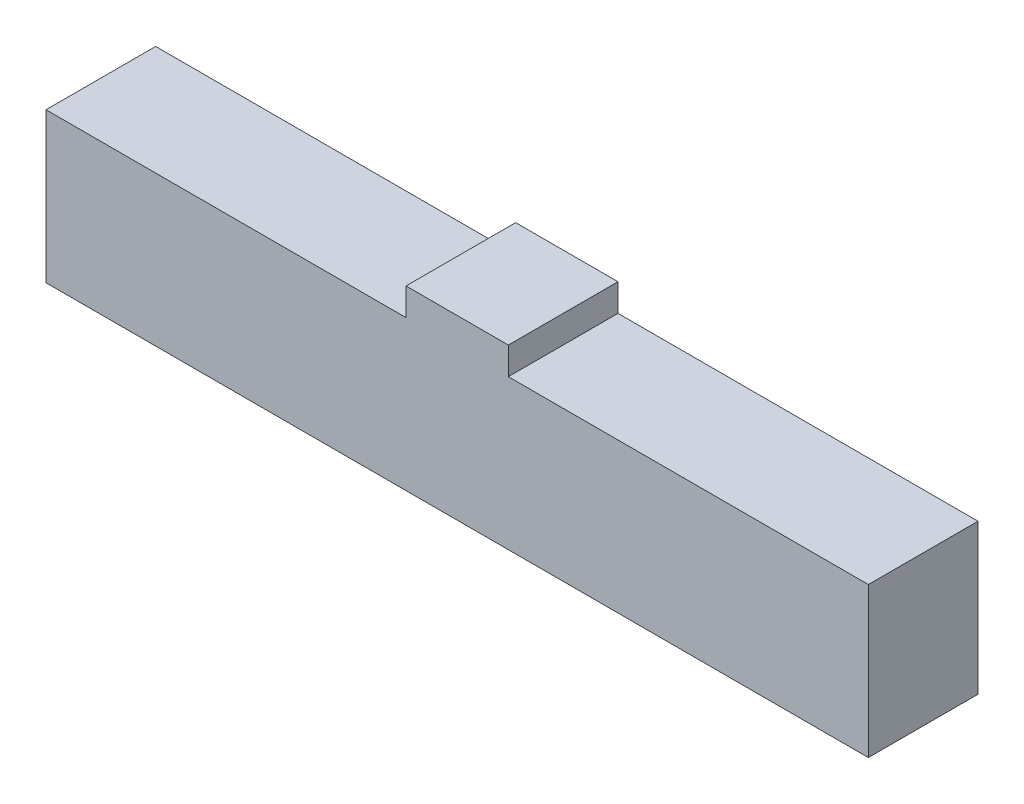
ISO-10303-21;
HEADER;
FILE_DESCRIPTION(('STEP AP214'),'2;1');
FILE_NAME('part.step','',(''),(''),'','','');
FILE_SCHEMA(('AUTOMOTIVE_DESIGN { 1 0 10303 214 1 1 1 1 }'));
ENDSEC;
DATA;
#1=APPLICATION_CONTEXT('core data for automotive mechanical design processes');
#2=APPLICATION_PROTOCOL_DEFINITION('international standard','automotive_design',2000,#1);
#3=PRODUCT_CONTEXT('',#1,'mechanical');
#4=PRODUCT('Part','Part','',(#3));
#5=PRODUCT_RELATED_PRODUCT_CATEGORY('part','',(#4));
#6=PRODUCT_DEFINITION_FORMATION('','',#4);
#7=PRODUCT_DEFINITION_CONTEXT('part definition',#1,'design');
#8=PRODUCT_DEFINITION('design','',#6,#7);
#9=PRODUCT_DEFINITION_SHAPE('','',#8);
#10=(LENGTH_UNIT() NAMED_UNIT(*) SI_UNIT(.MILLI.,.METRE.));
#11=(NAMED_UNIT(*) PLANE_ANGLE_UNIT() SI_UNIT($,.RADIAN.));
#12=(NAMED_UNIT(*) SI_UNIT($,.STERADIAN.) SOLID_ANGLE_UNIT());
#13=UNCERTAINTY_MEASURE_WITH_UNIT(LENGTH_MEASURE(1.E-05),#10,'distance_accuracy_value','');
#14=(GEOMETRIC_REPRESENTATION_CONTEXT(3) GLOBAL_UNCERTAINTY_ASSIGNED_CONTEXT((#13)) GLOBAL_UNIT_ASSIGNED_CONTEXT((#10,
#11,#12)) REPRESENTATION_CONTEXT('',''));
#15=CARTESIAN_POINT('',(0.,0.,0.));
#16=DIRECTION('',(0.,0.,1.));
#17=DIRECTION('',(1.,0.,0.));
#18=AXIS2_PLACEMENT_3D('',#15,#16,#17);
#19=CARTESIAN_POINT('',(1.8,3.1,6.));
#20=DIRECTION('',(0.,-1.,0.));
#21=DIRECTION('',(1.,0.,0.));
#22=AXIS2_PLACEMENT_3D('',#19,#20,#21);
#23=PLANE('',#22);
#24=DIRECTION('',(0.,0.,-1.));
#25=VECTOR('',#24,1.);
#26=CARTESIAN_POINT('',(21.5,3.1,6.));
#27=LINE('',#26,#25);
#28=CARTESIAN_POINT('',(21.5,3.1,5.));
#29=VERTEX_POINT('',#28);
#30=CARTESIAN_POINT('',(21.5,3.1,0.));
#31=VERTEX_POINT('',#30);
#32=EDGE_CURVE('E117',#29,#31,#27,.T.);
#33=ORIENTED_EDGE('',*,*,#32,.F.);
#34=DIRECTION('',(-1.,0.,0.));
#35=VECTOR('',#34,1.);
#36=CARTESIAN_POINT('',(1.8,3.1,5.));
#37=LINE('',#36,#35);
#38=CARTESIAN_POINT('',(1.8,3.1,5.));
#39=VERTEX_POINT('',#38);
#40=EDGE_CURVE('E111',#29,#39,#37,.T.);
#41=ORIENTED_EDGE('',*,*,#40,.T.);
#42=DIRECTION('',(0.,0.,-1.));
#43=VECTOR('',#42,1.);
#44=CARTESIAN_POINT('',(1.8,3.1,6.));
#45=LINE('',#44,#43);
#46=CARTESIAN_POINT('',(1.8,3.1,0.));
#47=VERTEX_POINT('',#46);
#48=EDGE_CURVE('E268',#39,#47,#45,.T.);
#49=ORIENTED_EDGE('',*,*,#48,.T.);
#50=DIRECTION('',(-1.,0.,0.));
#51=VECTOR('',#50,1.);
#52=CARTESIAN_POINT('',(1.8,3.1,0.));
#53=LINE('',#52,#51);
#54=EDGE_CURVE('E610',#31,#47,#53,.T.);
#55=ORIENTED_EDGE('',*,*,#54,.F.);
#56=EDGE_LOOP('',(#33,#41,#49,#55));
#57=FACE_BOUND('',#56,.T.);
#58=ADVANCED_FACE('F96',(#57),#23,.T.);
#59=CARTESIAN_POINT('',(1.8,4.6,6.));
#60=DIRECTION('',(-1.,0.,0.));
#61=DIRECTION('',(0.,0.,1.));
#62=AXIS2_PLACEMENT_3D('',#59,#60,#61);
#63=PLANE('',#62);
#64=ORIENTED_EDGE('',*,*,#48,.F.);
#65=DIRECTION('',(0.,1.,0.));
#66=VECTOR('',#65,1.);
#67=CARTESIAN_POINT('',(1.8,4.6,5.));
#68=LINE('',#67,#66);
#69=CARTESIAN_POINT('',(1.8,4.6,5.));
#70=VERTEX_POINT('',#69);
#71=EDGE_CURVE('E606',#39,#70,#68,.T.);
#72=ORIENTED_EDGE('',*,*,#71,.T.);
#73=DIRECTION('',(0.,0.,-1.));
#74=VECTOR('',#73,1.);
#75=CARTESIAN_POINT('',(1.8,4.6,6.));
#76=LINE('',#75,#74);
#77=CARTESIAN_POINT('',(1.8,4.6,0.));
#78=VERTEX_POINT('',#77);
#79=EDGE_CURVE('E266',#70,#78,#76,.T.);
#80=ORIENTED_EDGE('',*,*,#79,.T.);
#81=DIRECTION('',(0.,1.,0.));
#82=VECTOR('',#81,1.);
#83=CARTESIAN_POINT('',(1.8,4.6,0.));
#84=LINE('',#83,#82);
#85=EDGE_CURVE('E613',#47,#78,#84,.T.);
#86=ORIENTED_EDGE('',*,*,#85,.F.);
#87=EDGE_LOOP('',(#64,#72,#80,#86));
#88=FACE_BOUND('',#87,.T.);
#89=ADVANCED_FACE('F377',(#88),#63,.T.);
#90=CARTESIAN_POINT('',(0.4,4.6,6.));
#91=DIRECTION('',(0.,-1.,0.));
#92=DIRECTION('',(0.,0.,-1.));
#93=AXIS2_PLACEMENT_3D('',#90,#91,#92);
#94=PLANE('',#93);
#95=ORIENTED_EDGE('',*,*,#79,.F.);
#96=DIRECTION('',(-1.,0.,0.));
#97=VECTOR('',#96,1.);
#98=CARTESIAN_POINT('',(0.4,4.6,5.));
#99=LINE('',#98,#97);
#100=CARTESIAN_POINT('',(0.4,4.6,5.));
#101=VERTEX_POINT('',#100);
#102=EDGE_CURVE('E603',#70,#101,#99,.T.);
#103=ORIENTED_EDGE('',*,*,#102,.T.);
#104=DIRECTION('',(0.,0.,-1.));
#105=VECTOR('',#104,1.);
#106=CARTESIAN_POINT('',(0.4,4.6,6.));
#107=LINE('',#106,#105);
#108=CARTESIAN_POINT('',(0.4,4.6,0.));
#109=VERTEX_POINT('',#108);
#110=EDGE_CURVE('E264',#101,#109,#107,.T.);
#111=ORIENTED_EDGE('',*,*,#110,.T.);
#112=DIRECTION('',(-1.,0.,0.));
#113=VECTOR('',#112,1.);
#114=CARTESIAN_POINT('',(0.4,4.6,0.));
#115=LINE('',#114,#113);
#116=EDGE_CURVE('E616',#78,#109,#115,.T.);
#117=ORIENTED_EDGE('',*,*,#116,.F.);
#118=EDGE_LOOP('',(#95,#103,#111,#117));
#119=FACE_BOUND('',#118,.T.);
#120=ADVANCED_FACE('F382',(#119),#94,.T.);
#121=CARTESIAN_POINT('',(0.4,3.1,6.));
#122=DIRECTION('',(1.,0.,0.));
#123=DIRECTION('',(0.,0.,-1.));
#124=AXIS2_PLACEMENT_3D('',#121,#122,#123);
#125=PLANE('',#124);
#126=ORIENTED_EDGE('',*,*,#110,.F.);
#127=DIRECTION('',(0.,-1.,0.));
#128=VECTOR('',#127,1.);
#129=CARTESIAN_POINT('',(0.4,3.1,5.));
#130=LINE('',#129,#128);
#131=CARTESIAN_POINT('',(0.4,3.1,5.));
#132=VERTEX_POINT('',#131);
#133=EDGE_CURVE('E600',#101,#132,#130,.T.);
#134=ORIENTED_EDGE('',*,*,#133,.T.);
#135=DIRECTION('',(0.,0.,-1.));
#136=VECTOR('',#135,1.);
#137=CARTESIAN_POINT('',(0.4,3.1,6.));
#138=LINE('',#137,#136);
#139=CARTESIAN_POINT('',(0.4,3.1,0.));
#140=VERTEX_POINT('',#139);
#141=EDGE_CURVE('E262',#132,#140,#138,.T.);
#142=ORIENTED_EDGE('',*,*,#141,.T.);
#143=DIRECTION('',(0.,-1.,0.));
#144=VECTOR('',#143,1.);
#145=CARTESIAN_POINT('',(0.4,3.1,0.));
#146=LINE('',#145,#144);
#147=EDGE_CURVE('E619',#109,#140,#146,.T.);
#148=ORIENTED_EDGE('',*,*,#147,.F.);
#149=EDGE_LOOP('',(#126,#134,#142,#148));
#150=FACE_BOUND('',#149,.T.);
#151=ADVANCED_FACE('F388',(#150),#125,.T.);
#152=CARTESIAN_POINT('',(-0.4,3.1,6.));
#153=DIRECTION('',(0.,-1.,0.));
#154=DIRECTION('',(0.,0.,-1.));
#155=AXIS2_PLACEMENT_3D('',#152,#153,#154);
#156=PLANE('',#155);
#157=ORIENTED_EDGE('',*,*,#141,.F.);
#158=DIRECTION('',(-1.,0.,0.));
#159=VECTOR('',#158,1.);
#160=CARTESIAN_POINT('',(-0.4,3.1,5.));
#161=LINE('',#160,#159);
#162=CARTESIAN_POINT('',(-0.4,3.1,5.));
#163=VERTEX_POINT('',#162);
#164=EDGE_CURVE('E597',#132,#163,#161,.T.);
#165=ORIENTED_EDGE('',*,*,#164,.T.);
#166=DIRECTION('',(0.,0.,-1.));
#167=VECTOR('',#166,1.);
#168=CARTESIAN_POINT('',(-0.4,3.1,6.));
#169=LINE('',#168,#167);
#170=CARTESIAN_POINT('',(-0.4,3.1,0.));
#171=VERTEX_POINT('',#170);
#172=EDGE_CURVE('E260',#163,#171,#169,.T.);
#173=ORIENTED_EDGE('',*,*,#172,.T.);
#174=DIRECTION('',(-1.,0.,0.));
#175=VECTOR('',#174,1.);
#176=CARTESIAN_POINT('',(-0.4,3.1,0.));
#177=LINE('',#176,#175);
#178=EDGE_CURVE('E622',#140,#171,#177,.T.);
#179=ORIENTED_EDGE('',*,*,#178,.F.);
#180=EDGE_LOOP('',(#157,#165,#173,#179));
#181=FACE_BOUND('',#180,.T.);
#182=ADVANCED_FACE('F392',(#181),#156,.T.);
#183=CARTESIAN_POINT('',(-0.4,4.6,6.));
#184=DIRECTION('',(-1.,0.,0.));
#185=DIRECTION('',(0.,0.,1.));
#186=AXIS2_PLACEMENT_3D('',#183,#184,#185);
#187=PLANE('',#186);
#188=ORIENTED_EDGE('',*,*,#172,.F.);
#189=DIRECTION('',(0.,1.,0.));
#190=VECTOR('',#189,1.);
#191=CARTESIAN_POINT('',(-0.4,4.6,5.));
#192=LINE('',#191,#190);
#193=CARTESIAN_POINT('',(-0.4,4.6,5.));
#194=VERTEX_POINT('',#193);
#195=EDGE_CURVE('E594',#163,#194,#192,.T.);
#196=ORIENTED_EDGE('',*,*,#195,.T.);
#197=DIRECTION('',(0.,0.,-1.));
#198=VECTOR('',#197,1.);
#199=CARTESIAN_POINT('',(-0.4,4.6,6.));
#200=LINE('',#199,#198);
#201=CARTESIAN_POINT('',(-0.4,4.6,0.));
#202=VERTEX_POINT('',#201);
#203=EDGE_CURVE('E258',#194,#202,#200,.T.);
#204=ORIENTED_EDGE('',*,*,#203,.T.);
#205=DIRECTION('',(0.,1.,0.));
#206=VECTOR('',#205,1.);
#207=CARTESIAN_POINT('',(-0.4,4.6,0.));
#208=LINE('',#207,#206);
#209=EDGE_CURVE('E625',#171,#202,#208,.T.);
#210=ORIENTED_EDGE('',*,*,#209,.F.);
#211=EDGE_LOOP('',(#188,#196,#204,#210));
#212=FACE_BOUND('',#211,.T.);
#213=ADVANCED_FACE('F396',(#212),#187,.T.);
#214=CARTESIAN_POINT('',(-1.8,4.6,6.));
#215=DIRECTION('',(0.,-1.,0.));
#216=DIRECTION('',(0.,0.,-1.));
#217=AXIS2_PLACEMENT_3D('',#214,#215,#216);
#218=PLANE('',#217);
#219=ORIENTED_EDGE('',*,*,#203,.F.);
#220=DIRECTION('',(-1.,0.,0.));
#221=VECTOR('',#220,1.);
#222=CARTESIAN_POINT('',(-1.8,4.6,5.));
#223=LINE('',#222,#221);
#224=CARTESIAN_POINT('',(-1.8,4.6,5.));
#225=VERTEX_POINT('',#224);
#226=EDGE_CURVE('E588',#194,#225,#223,.T.);
#227=ORIENTED_EDGE('',*,*,#226,.T.);
#228=DIRECTION('',(0.,0.,-1.));
#229=VECTOR('',#228,1.);
#230=CARTESIAN_POINT('',(-1.8,4.6,6.));
#231=LINE('',#230,#229);
#232=CARTESIAN_POINT('',(-1.8,4.6,0.));
#233=VERTEX_POINT('',#232);
#234=EDGE_CURVE('E256',#225,#233,#231,.T.);
#235=ORIENTED_EDGE('',*,*,#234,.T.);
#236=DIRECTION('',(-1.,0.,0.));
#237=VECTOR('',#236,1.);
#238=CARTESIAN_POINT('',(-1.8,4.6,0.));
#239=LINE('',#238,#237);
#240=EDGE_CURVE('E628',#202,#233,#239,.T.);
#241=ORIENTED_EDGE('',*,*,#240,.F.);
#242=EDGE_LOOP('',(#219,#227,#235,#241));
#243=FACE_BOUND('',#242,.T.);
#244=ADVANCED_FACE('F400',(#243),#218,.T.);
#245=CARTESIAN_POINT('',(-1.8,3.1,6.));
#246=DIRECTION('',(1.,0.,0.));
#247=DIRECTION('',(0.,0.,-1.));
#248=AXIS2_PLACEMENT_3D('',#245,#246,#247);
#249=PLANE('',#248);
#250=ORIENTED_EDGE('',*,*,#234,.F.);
#251=DIRECTION('',(0.,-1.,0.));
#252=VECTOR('',#251,1.);
#253=CARTESIAN_POINT('',(-1.8,3.1,5.));
#254=LINE('',#253,#252);
#255=CARTESIAN_POINT('',(-1.8,3.1,5.));
#256=VERTEX_POINT('',#255);
#257=EDGE_CURVE('E586',#225,#256,#254,.T.);
#258=ORIENTED_EDGE('',*,*,#257,.T.);
#259=DIRECTION('',(0.,0.,-1.));
#260=VECTOR('',#259,1.);
#261=CARTESIAN_POINT('',(-1.8,3.1,6.));
#262=LINE('',#261,#260);
#263=CARTESIAN_POINT('',(-1.8,3.1,0.));
#264=VERTEX_POINT('',#263);
#265=EDGE_CURVE('E254',#256,#264,#262,.T.);
#266=ORIENTED_EDGE('',*,*,#265,.T.);
#267=DIRECTION('',(0.,-1.,0.));
#268=VECTOR('',#267,1.);
#269=CARTESIAN_POINT('',(-1.8,3.1,0.));
#270=LINE('',#269,#268);
#271=EDGE_CURVE('E631',#233,#264,#270,.T.);
#272=ORIENTED_EDGE('',*,*,#271,.F.);
#273=EDGE_LOOP('',(#250,#258,#266,#272));
#274=FACE_BOUND('',#273,.T.);
#275=ADVANCED_FACE('F404',(#274),#249,.T.);
#276=CARTESIAN_POINT('',(-21.5,3.1,6.));
#277=DIRECTION('',(0.,-1.,0.));
#278=DIRECTION('',(0.,0.,-1.));
#279=AXIS2_PLACEMENT_3D('',#276,#277,#278);
#280=PLANE('',#279);
#281=ORIENTED_EDGE('',*,*,#265,.F.);
#282=DIRECTION('',(-1.,0.,0.));
#283=VECTOR('',#282,1.);
#284=CARTESIAN_POINT('',(-21.5,3.1,5.));
#285=LINE('',#284,#283);
#286=CARTESIAN_POINT('',(-21.5,3.1,5.));
#287=VERTEX_POINT('',#286);
#288=EDGE_CURVE('E584',#256,#287,#285,.T.);
#289=ORIENTED_EDGE('',*,*,#288,.T.);
#290=DIRECTION('',(0.,0.,-1.));
#291=VECTOR('',#290,1.);
#292=CARTESIAN_POINT('',(-21.5,3.1,6.));
#293=LINE('',#292,#291);
#294=CARTESIAN_POINT('',(-21.5,3.1,0.));
#295=VERTEX_POINT('',#294);
#296=EDGE_CURVE('E248',#287,#295,#293,.T.);
#297=ORIENTED_EDGE('',*,*,#296,.T.);
#298=DIRECTION('',(-1.,0.,0.));
#299=VECTOR('',#298,1.);
#300=CARTESIAN_POINT('',(-21.5,3.1,0.));
#301=LINE('',#300,#299);
#302=EDGE_CURVE('E582',#264,#295,#301,.T.);
#303=ORIENTED_EDGE('',*,*,#302,.F.);
#304=EDGE_LOOP('',(#281,#289,#297,#303));
#305=FACE_BOUND('',#304,.T.);
#306=ADVANCED_FACE('F408',(#305),#280,.T.);
#307=CARTESIAN_POINT('',(-21.5,-3.1,6.));
#308=DIRECTION('',(1.,0.,0.));
#309=DIRECTION('',(0.,0.,-1.));
#310=AXIS2_PLACEMENT_3D('',#307,#308,#309);
#311=PLANE('',#310);
#312=ORIENTED_EDGE('',*,*,#296,.F.);
#313=DIRECTION('',(0.,-1.,0.));
#314=VECTOR('',#313,1.);
#315=CARTESIAN_POINT('',(-21.5,-3.1,5.));
#316=LINE('',#315,#314);
#317=CARTESIAN_POINT('',(-21.5,-3.1,5.));
#318=VERTEX_POINT('',#317);
#319=EDGE_CURVE('E241',#287,#318,#316,.T.);
#320=ORIENTED_EDGE('',*,*,#319,.T.);
#321=DIRECTION('',(0.,0.,-1.));
#322=VECTOR('',#321,1.);
#323=CARTESIAN_POINT('',(-21.5,-3.1,6.));
#324=LINE('',#323,#322);
#325=CARTESIAN_POINT('',(-21.5,-3.1,0.));
#326=VERTEX_POINT('',#325);
#327=EDGE_CURVE('E240',#318,#326,#324,.T.);
#328=ORIENTED_EDGE('',*,*,#327,.T.);
#329=DIRECTION('',(0.,-1.,0.));
#330=VECTOR('',#329,1.);
#331=CARTESIAN_POINT('',(-21.5,-3.1,0.));
#332=LINE('',#331,#330);
#333=EDGE_CURVE('E577',#295,#326,#332,.T.);
#334=ORIENTED_EDGE('',*,*,#333,.F.);
#335=EDGE_LOOP('',(#312,#320,#328,#334));
#336=FACE_BOUND('',#335,.T.);
#337=ADVANCED_FACE('F412',(#336),#311,.T.);
#338=CARTESIAN_POINT('',(-21.5,-3.1,6.));
#339=DIRECTION('',(0.,1.,0.));
#340=DIRECTION('',(0.,0.,1.));
#341=AXIS2_PLACEMENT_3D('',#338,#339,#340);
#342=PLANE('',#341);
#343=ORIENTED_EDGE('',*,*,#327,.F.);
#344=DIRECTION('',(1.,0.,0.));
#345=VECTOR('',#344,1.);
#346=CARTESIAN_POINT('',(-21.5,-3.1,5.));
#347=LINE('',#346,#345);
#348=CARTESIAN_POINT('',(21.5,-3.1,5.));
#349=VERTEX_POINT('',#348);
#350=EDGE_CURVE('E232',#318,#349,#347,.T.);
#351=ORIENTED_EDGE('',*,*,#350,.T.);
#352=DIRECTION('',(0.,0.,-1.));
#353=VECTOR('',#352,1.);
#354=CARTESIAN_POINT('',(21.5,-3.1,6.));
#355=LINE('',#354,#353);
#356=CARTESIAN_POINT('',(21.5,-3.1,0.));
#357=VERTEX_POINT('',#356);
#358=EDGE_CURVE('E239',#349,#357,#355,.T.);
#359=ORIENTED_EDGE('',*,*,#358,.T.);
#360=DIRECTION('',(1.,0.,0.));
#361=VECTOR('',#360,1.);
#362=CARTESIAN_POINT('',(-21.5,-3.1,0.));
#363=LINE('',#362,#361);
#364=EDGE_CURVE('E635',#326,#357,#363,.T.);
#365=ORIENTED_EDGE('',*,*,#364,.F.);
#366=EDGE_LOOP('',(#343,#351,#359,#365));
#367=FACE_BOUND('',#366,.T.);
#368=ADVANCED_FACE('F237',(#367),#342,.T.);
#369=CARTESIAN_POINT('',(21.5,-3.1,6.));
#370=DIRECTION('',(-1.,0.,0.));
#371=DIRECTION('',(0.,0.,1.));
#372=AXIS2_PLACEMENT_3D('',#369,#370,#371);
#373=PLANE('',#372);
#374=ORIENTED_EDGE('',*,*,#358,.F.);
#375=DIRECTION('',(0.,1.,0.));
#376=VECTOR('',#375,1.);
#377=CARTESIAN_POINT('',(21.5,-3.1,5.));
#378=LINE('',#377,#376);
#379=EDGE_CURVE('E12',#349,#29,#378,.T.);
#380=ORIENTED_EDGE('',*,*,#379,.T.);
#381=ORIENTED_EDGE('',*,*,#32,.T.);
#382=DIRECTION('',(0.,1.,0.));
#383=VECTOR('',#382,1.);
#384=CARTESIAN_POINT('',(21.5,-3.1,0.));
#385=LINE('',#384,#383);
#386=EDGE_CURVE('E245',#357,#31,#385,.T.);
#387=ORIENTED_EDGE('',*,*,#386,.F.);
#388=EDGE_LOOP('',(#374,#380,#381,#387));
#389=FACE_BOUND('',#388,.T.);
#390=ADVANCED_FACE('F243',(#389),#373,.T.);
#391=CARTESIAN_POINT('',(2.8,4.1,6.));
#392=DIRECTION('',(0.,0.,-1.));
#393=DIRECTION('',(-1.,0.,0.));
#394=AXIS2_PLACEMENT_3D('',#391,#392,#393);
#395=PLANE('',#394);
#396=DIRECTION('',(-1.,0.,0.));
#397=VECTOR('',#396,1.);
#398=CARTESIAN_POINT('',(1.8,4.1,6.));
#399=LINE('',#398,#397);
#400=CARTESIAN_POINT('',(22.5,4.1,6.));
#401=VERTEX_POINT('',#400);
#402=CARTESIAN_POINT('',(2.8,4.1,6.));
#403=VERTEX_POINT('',#402);
#404=EDGE_CURVE('E271',#401,#403,#399,.T.);
#405=ORIENTED_EDGE('',*,*,#404,.T.);
#406=DIRECTION('',(0.,1.,0.));
#407=VECTOR('',#406,1.);
#408=CARTESIAN_POINT('',(2.8,4.6,6.));
#409=LINE('',#408,#407);
#410=CARTESIAN_POINT('',(2.8,5.6,6.));
#411=VERTEX_POINT('',#410);
#412=EDGE_CURVE('E274',#403,#411,#409,.T.);
#413=ORIENTED_EDGE('',*,*,#412,.T.);
#414=DIRECTION('',(-1.,0.,0.));
#415=VECTOR('',#414,1.);
#416=CARTESIAN_POINT('',(-1.8,5.6,6.));
#417=LINE('',#416,#415);
#418=CARTESIAN_POINT('',(-2.8,5.6,6.));
#419=VERTEX_POINT('',#418);
#420=EDGE_CURVE('E277',#411,#419,#417,.T.);
#421=ORIENTED_EDGE('',*,*,#420,.T.);
#422=DIRECTION('',(0.,-1.,0.));
#423=VECTOR('',#422,1.);
#424=CARTESIAN_POINT('',(-2.8,3.1,6.));
#425=LINE('',#424,#423);
#426=CARTESIAN_POINT('',(-2.8,4.1,6.));
#427=VERTEX_POINT('',#426);
#428=EDGE_CURVE('E279',#419,#427,#425,.T.);
#429=ORIENTED_EDGE('',*,*,#428,.T.);
#430=DIRECTION('',(-1.,0.,0.));
#431=VECTOR('',#430,1.);
#432=CARTESIAN_POINT('',(-21.5,4.1,6.));
#433=LINE('',#432,#431);
#434=CARTESIAN_POINT('',(-22.5,4.1,6.));
#435=VERTEX_POINT('',#434);
#436=EDGE_CURVE('E281',#427,#435,#433,.T.);
#437=ORIENTED_EDGE('',*,*,#436,.T.);
#438=DIRECTION('',(0.,-1.,0.));
#439=VECTOR('',#438,1.);
#440=CARTESIAN_POINT('',(-22.5,-3.1,6.));
#441=LINE('',#440,#439);
#442=CARTESIAN_POINT('',(-22.5,-4.1,6.));
#443=VERTEX_POINT('',#442);
#444=EDGE_CURVE('E283',#435,#443,#441,.T.);
#445=ORIENTED_EDGE('',*,*,#444,.T.);
#446=DIRECTION('',(1.,0.,0.));
#447=VECTOR('',#446,1.);
#448=CARTESIAN_POINT('',(-21.5,-4.1,6.));
#449=LINE('',#448,#447);
#450=CARTESIAN_POINT('',(22.5,-4.1,6.));
#451=VERTEX_POINT('',#450);
#452=EDGE_CURVE('E285',#443,#451,#449,.T.);
#453=ORIENTED_EDGE('',*,*,#452,.T.);
#454=DIRECTION('',(0.,1.,0.));
#455=VECTOR('',#454,1.);
#456=CARTESIAN_POINT('',(22.5,-3.1,6.));
#457=LINE('',#456,#455);
#458=EDGE_CURVE('E287',#451,#401,#457,.T.);
#459=ORIENTED_EDGE('',*,*,#458,.T.);
#460=EDGE_LOOP('',(#405,#413,#421,#429,#437,#445,#453,#459));
#461=FACE_BOUND('',#460,.T.);
#462=ADVANCED_FACE('F366',(#461),#395,.F.);
#463=CARTESIAN_POINT('',(2.8,4.1,0.));
#464=DIRECTION('',(0.,0.,-1.));
#465=DIRECTION('',(-1.,0.,0.));
#466=AXIS2_PLACEMENT_3D('',#463,#464,#465);
#467=PLANE('',#466);
#468=DIRECTION('',(-1.,0.,0.));
#469=VECTOR('',#468,1.);
#470=CARTESIAN_POINT('',(1.8,4.1,0.));
#471=LINE('',#470,#469);
#472=CARTESIAN_POINT('',(22.5,4.1,0.));
#473=VERTEX_POINT('',#472);
#474=CARTESIAN_POINT('',(2.8,4.1,0.));
#475=VERTEX_POINT('',#474);
#476=EDGE_CURVE('E270',#473,#475,#471,.T.);
#477=ORIENTED_EDGE('',*,*,#476,.F.);
#478=DIRECTION('',(0.,1.,0.));
#479=VECTOR('',#478,1.);
#480=CARTESIAN_POINT('',(22.5,-3.1,0.));
#481=LINE('',#480,#479);
#482=CARTESIAN_POINT('',(22.5,-4.1,0.));
#483=VERTEX_POINT('',#482);
#484=EDGE_CURVE('E275',#483,#473,#481,.T.);
#485=ORIENTED_EDGE('',*,*,#484,.F.);
#486=DIRECTION('',(1.,0.,0.));
#487=VECTOR('',#486,1.);
#488=CARTESIAN_POINT('',(-21.5,-4.1,0.));
#489=LINE('',#488,#487);
#490=CARTESIAN_POINT('',(-22.5,-4.1,0.));
#491=VERTEX_POINT('',#490);
#492=EDGE_CURVE('E307',#491,#483,#489,.T.);
#493=ORIENTED_EDGE('',*,*,#492,.F.);
#494=DIRECTION('',(0.,-1.,0.));
#495=VECTOR('',#494,1.);
#496=CARTESIAN_POINT('',(-22.5,-3.1,0.));
#497=LINE('',#496,#495);
#498=CARTESIAN_POINT('',(-22.5,4.1,0.));
#499=VERTEX_POINT('',#498);
#500=EDGE_CURVE('E304',#499,#491,#497,.T.);
#501=ORIENTED_EDGE('',*,*,#500,.F.);
#502=DIRECTION('',(-1.,0.,0.));
#503=VECTOR('',#502,1.);
#504=CARTESIAN_POINT('',(-21.5,4.1,0.));
#505=LINE('',#504,#503);
#506=CARTESIAN_POINT('',(-2.8,4.1,0.));
#507=VERTEX_POINT('',#506);
#508=EDGE_CURVE('E301',#507,#499,#505,.T.);
#509=ORIENTED_EDGE('',*,*,#508,.F.);
#510=DIRECTION('',(0.,-1.,0.));
#511=VECTOR('',#510,1.);
#512=CARTESIAN_POINT('',(-2.8,3.1,0.));
#513=LINE('',#512,#511);
#514=CARTESIAN_POINT('',(-2.8,5.6,0.));
#515=VERTEX_POINT('',#514);
#516=EDGE_CURVE('E298',#515,#507,#513,.T.);
#517=ORIENTED_EDGE('',*,*,#516,.F.);
#518=DIRECTION('',(-1.,0.,0.));
#519=VECTOR('',#518,1.);
#520=CARTESIAN_POINT('',(-1.8,5.6,0.));
#521=LINE('',#520,#519);
#522=CARTESIAN_POINT('',(2.8,5.6,0.));
#523=VERTEX_POINT('',#522);
#524=EDGE_CURVE('E295',#523,#515,#521,.T.);
#525=ORIENTED_EDGE('',*,*,#524,.F.);
#526=DIRECTION('',(0.,1.,0.));
#527=VECTOR('',#526,1.);
#528=CARTESIAN_POINT('',(2.8,4.6,0.));
#529=LINE('',#528,#527);
#530=EDGE_CURVE('E292',#475,#523,#529,.T.);
#531=ORIENTED_EDGE('',*,*,#530,.F.);
#532=EDGE_LOOP('',(#477,#485,#493,#501,#509,#517,#525,#531));
#533=FACE_BOUND('',#532,.T.);
#534=ORIENTED_EDGE('',*,*,#386,.T.);
#535=ORIENTED_EDGE('',*,*,#54,.T.);
#536=ORIENTED_EDGE('',*,*,#85,.T.);
#537=ORIENTED_EDGE('',*,*,#116,.T.);
#538=ORIENTED_EDGE('',*,*,#147,.T.);
#539=ORIENTED_EDGE('',*,*,#178,.T.);
#540=ORIENTED_EDGE('',*,*,#209,.T.);
#541=ORIENTED_EDGE('',*,*,#240,.T.);
#542=ORIENTED_EDGE('',*,*,#271,.T.);
#543=ORIENTED_EDGE('',*,*,#302,.T.);
#544=ORIENTED_EDGE('',*,*,#333,.T.);
#545=ORIENTED_EDGE('',*,*,#364,.T.);
#546=EDGE_LOOP('',(#534,#535,#536,#537,#538,#539,#540,#541,#542,#543,#544,#545));
#547=FACE_BOUND('',#546,.T.);
#548=ADVANCED_FACE('F334',(#533,#547),#467,.T.);
#549=CARTESIAN_POINT('',(1.8,4.1,6.));
#550=DIRECTION('',(0.,-1.,0.));
#551=DIRECTION('',(1.,0.,0.));
#552=AXIS2_PLACEMENT_3D('',#549,#550,#551);
#553=PLANE('',#552);
#554=DIRECTION('',(0.,0.,-1.));
#555=VECTOR('',#554,1.);
#556=CARTESIAN_POINT('',(22.5,4.1,6.));
#557=LINE('',#556,#555);
#558=EDGE_CURVE('E289',#401,#473,#557,.T.);
#559=ORIENTED_EDGE('',*,*,#558,.T.);
#560=ORIENTED_EDGE('',*,*,#476,.T.);
#561=DIRECTION('',(0.,0.,-1.));
#562=VECTOR('',#561,1.);
#563=CARTESIAN_POINT('',(2.8,4.1,6.));
#564=LINE('',#563,#562);
#565=EDGE_CURVE('E104',#403,#475,#564,.T.);
#566=ORIENTED_EDGE('',*,*,#565,.F.);
#567=ORIENTED_EDGE('',*,*,#404,.F.);
#568=EDGE_LOOP('',(#559,#560,#566,#567));
#569=FACE_BOUND('',#568,.T.);
#570=ADVANCED_FACE('F98',(#569),#553,.F.);
#571=CARTESIAN_POINT('',(2.8,4.6,6.));
#572=DIRECTION('',(-1.,0.,0.));
#573=DIRECTION('',(0.,0.,1.));
#574=AXIS2_PLACEMENT_3D('',#571,#572,#573);
#575=PLANE('',#574);
#576=ORIENTED_EDGE('',*,*,#565,.T.);
#577=ORIENTED_EDGE('',*,*,#530,.T.);
#578=DIRECTION('',(0.,0.,-1.));
#579=VECTOR('',#578,1.);
#580=CARTESIAN_POINT('',(2.8,5.6,6.));
#581=LINE('',#580,#579);
#582=EDGE_CURVE('E323',#411,#523,#581,.T.);
#583=ORIENTED_EDGE('',*,*,#582,.F.);
#584=ORIENTED_EDGE('',*,*,#412,.F.);
#585=EDGE_LOOP('',(#576,#577,#583,#584));
#586=FACE_BOUND('',#585,.T.);
#587=ADVANCED_FACE('F327',(#586),#575,.F.);
#588=CARTESIAN_POINT('',(-1.8,5.6,6.));
#589=DIRECTION('',(0.,-1.,0.));
#590=DIRECTION('',(0.,0.,-1.));
#591=AXIS2_PLACEMENT_3D('',#588,#589,#590);
#592=PLANE('',#591);
#593=ORIENTED_EDGE('',*,*,#582,.T.);
#594=ORIENTED_EDGE('',*,*,#524,.T.);
#595=DIRECTION('',(0.,0.,-1.));
#596=VECTOR('',#595,1.);
#597=CARTESIAN_POINT('',(-2.8,5.6,6.));
#598=LINE('',#597,#596);
#599=EDGE_CURVE('E321',#419,#515,#598,.T.);
#600=ORIENTED_EDGE('',*,*,#599,.F.);
#601=ORIENTED_EDGE('',*,*,#420,.F.);
#602=EDGE_LOOP('',(#593,#594,#600,#601));
#603=FACE_BOUND('',#602,.T.);
#604=ADVANCED_FACE('F364',(#603),#592,.F.);
#605=CARTESIAN_POINT('',(-2.8,3.1,6.));
#606=DIRECTION('',(1.,0.,0.));
#607=DIRECTION('',(0.,0.,-1.));
#608=AXIS2_PLACEMENT_3D('',#605,#606,#607);
#609=PLANE('',#608);
#610=ORIENTED_EDGE('',*,*,#599,.T.);
#611=ORIENTED_EDGE('',*,*,#516,.T.);
#612=DIRECTION('',(0.,0.,-1.));
#613=VECTOR('',#612,1.);
#614=CARTESIAN_POINT('',(-2.8,4.1,6.));
#615=LINE('',#614,#613);
#616=EDGE_CURVE('E319',#427,#507,#615,.T.);
#617=ORIENTED_EDGE('',*,*,#616,.F.);
#618=ORIENTED_EDGE('',*,*,#428,.F.);
#619=EDGE_LOOP('',(#610,#611,#617,#618));
#620=FACE_BOUND('',#619,.T.);
#621=ADVANCED_FACE('F359',(#620),#609,.F.);
#622=CARTESIAN_POINT('',(-21.5,4.1,6.));
#623=DIRECTION('',(0.,-1.,0.));
#624=DIRECTION('',(0.,0.,-1.));
#625=AXIS2_PLACEMENT_3D('',#622,#623,#624);
#626=PLANE('',#625);
#627=ORIENTED_EDGE('',*,*,#616,.T.);
#628=ORIENTED_EDGE('',*,*,#508,.T.);
#629=DIRECTION('',(0.,0.,-1.));
#630=VECTOR('',#629,1.);
#631=CARTESIAN_POINT('',(-22.5,4.1,6.));
#632=LINE('',#631,#630);
#633=EDGE_CURVE('E317',#435,#499,#632,.T.);
#634=ORIENTED_EDGE('',*,*,#633,.F.);
#635=ORIENTED_EDGE('',*,*,#436,.F.);
#636=EDGE_LOOP('',(#627,#628,#634,#635));
#637=FACE_BOUND('',#636,.T.);
#638=ADVANCED_FACE('F356',(#637),#626,.F.);
#639=CARTESIAN_POINT('',(-22.5,-3.1,6.));
#640=DIRECTION('',(1.,0.,0.));
#641=DIRECTION('',(0.,0.,-1.));
#642=AXIS2_PLACEMENT_3D('',#639,#640,#641);
#643=PLANE('',#642);
#644=ORIENTED_EDGE('',*,*,#633,.T.);
#645=ORIENTED_EDGE('',*,*,#500,.T.);
#646=DIRECTION('',(0.,0.,-1.));
#647=VECTOR('',#646,1.);
#648=CARTESIAN_POINT('',(-22.5,-4.1,6.));
#649=LINE('',#648,#647);
#650=EDGE_CURVE('E315',#443,#491,#649,.T.);
#651=ORIENTED_EDGE('',*,*,#650,.F.);
#652=ORIENTED_EDGE('',*,*,#444,.F.);
#653=EDGE_LOOP('',(#644,#645,#651,#652));
#654=FACE_BOUND('',#653,.T.);
#655=ADVANCED_FACE('F352',(#654),#643,.F.);
#656=CARTESIAN_POINT('',(-21.5,-4.1,6.));
#657=DIRECTION('',(0.,1.,0.));
#658=DIRECTION('',(0.,0.,1.));
#659=AXIS2_PLACEMENT_3D('',#656,#657,#658);
#660=PLANE('',#659);
#661=ORIENTED_EDGE('',*,*,#650,.T.);
#662=ORIENTED_EDGE('',*,*,#492,.T.);
#663=DIRECTION('',(0.,0.,-1.));
#664=VECTOR('',#663,1.);
#665=CARTESIAN_POINT('',(22.5,-4.1,6.));
#666=LINE('',#665,#664);
#667=EDGE_CURVE('E313',#451,#483,#666,.T.);
#668=ORIENTED_EDGE('',*,*,#667,.F.);
#669=ORIENTED_EDGE('',*,*,#452,.F.);
#670=EDGE_LOOP('',(#661,#662,#668,#669));
#671=FACE_BOUND('',#670,.T.);
#672=ADVANCED_FACE('F347',(#671),#660,.F.);
#673=CARTESIAN_POINT('',(22.5,-3.1,6.));
#674=DIRECTION('',(-1.,0.,0.));
#675=DIRECTION('',(0.,0.,1.));
#676=AXIS2_PLACEMENT_3D('',#673,#674,#675);
#677=PLANE('',#676);
#678=ORIENTED_EDGE('',*,*,#667,.T.);
#679=ORIENTED_EDGE('',*,*,#484,.T.);
#680=ORIENTED_EDGE('',*,*,#558,.F.);
#681=ORIENTED_EDGE('',*,*,#458,.F.);
#682=EDGE_LOOP('',(#678,#679,#680,#681));
#683=FACE_BOUND('',#682,.T.);
#684=ADVANCED_FACE('F341',(#683),#677,.F.);
#685=CARTESIAN_POINT('',(22.5,4.1,5.));
#686=DIRECTION('',(0.,0.,1.));
#687=DIRECTION('',(1.,0.,0.));
#688=AXIS2_PLACEMENT_3D('',#685,#686,#687);
#689=PLANE('',#688);
#690=ORIENTED_EDGE('',*,*,#40,.F.);
#691=ORIENTED_EDGE('',*,*,#379,.F.);
#692=ORIENTED_EDGE('',*,*,#350,.F.);
#693=ORIENTED_EDGE('',*,*,#319,.F.);
#694=ORIENTED_EDGE('',*,*,#288,.F.);
#695=ORIENTED_EDGE('',*,*,#257,.F.);
#696=ORIENTED_EDGE('',*,*,#226,.F.);
#697=ORIENTED_EDGE('',*,*,#195,.F.);
#698=ORIENTED_EDGE('',*,*,#164,.F.);
#699=ORIENTED_EDGE('',*,*,#133,.F.);
#700=ORIENTED_EDGE('',*,*,#102,.F.);
#701=ORIENTED_EDGE('',*,*,#71,.F.);
#702=EDGE_LOOP('',(#690,#691,#692,#693,#694,#695,#696,#697,#698,#699,#700,#701));
#703=FACE_BOUND('',#702,.T.);
#704=ADVANCED_FACE('F231',(#703),#689,.F.);
#705=CLOSED_SHELL('',(#58,#89,#120,#151,#182,#213,#244,#275,#306,#337,#368,#390,#462,#548,#570,
#587,#604,#621,#638,#655,#672,#684,#704));
#706=MANIFOLD_SOLID_BREP('B2',#705);
#707=ADVANCED_BREP_SHAPE_REPRESENTATION('',(#18,#706),#14);
#708=SHAPE_DEFINITION_REPRESENTATION(#9,#707);
ENDSEC;
END-ISO-10303-21;
